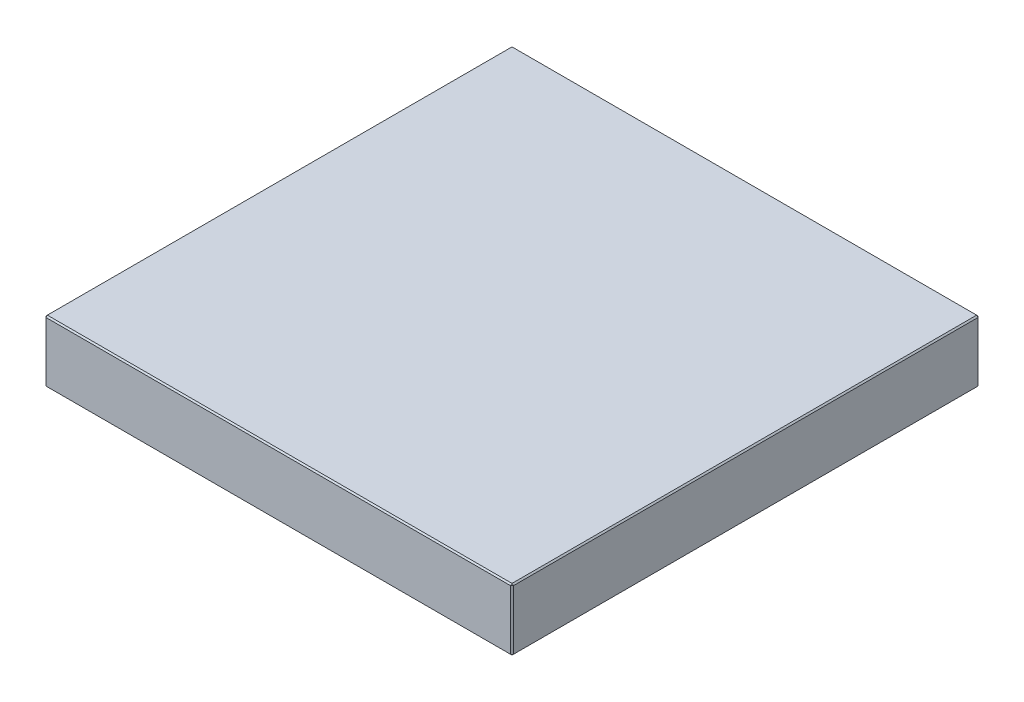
ISO-10303-21;
HEADER;
FILE_DESCRIPTION(('STEP AP214'),'2;1');
FILE_NAME('part.step','',(''),(''),'','','');
FILE_SCHEMA(('AUTOMOTIVE_DESIGN { 1 0 10303 214 1 1 1 1 }'));
ENDSEC;
DATA;
#1=APPLICATION_CONTEXT('core data for automotive mechanical design processes');
#2=APPLICATION_PROTOCOL_DEFINITION('international standard','automotive_design',2000,#1);
#3=PRODUCT_CONTEXT('',#1,'mechanical');
#4=PRODUCT('Part','Part','',(#3));
#5=PRODUCT_RELATED_PRODUCT_CATEGORY('part','',(#4));
#6=PRODUCT_DEFINITION_FORMATION('','',#4);
#7=PRODUCT_DEFINITION_CONTEXT('part definition',#1,'design');
#8=PRODUCT_DEFINITION('design','',#6,#7);
#9=PRODUCT_DEFINITION_SHAPE('','',#8);
#10=(LENGTH_UNIT() NAMED_UNIT(*) SI_UNIT(.MILLI.,.METRE.));
#11=(NAMED_UNIT(*) PLANE_ANGLE_UNIT() SI_UNIT($,.RADIAN.));
#12=(NAMED_UNIT(*) SI_UNIT($,.STERADIAN.) SOLID_ANGLE_UNIT());
#13=UNCERTAINTY_MEASURE_WITH_UNIT(LENGTH_MEASURE(1.E-05),#10,'distance_accuracy_value','');
#14=(GEOMETRIC_REPRESENTATION_CONTEXT(3) GLOBAL_UNCERTAINTY_ASSIGNED_CONTEXT((#13)) GLOBAL_UNIT_ASSIGNED_CONTEXT((#10,
#11,#12)) REPRESENTATION_CONTEXT('',''));
#15=CARTESIAN_POINT('',(0.,0.,0.));
#16=DIRECTION('',(0.,0.,1.));
#17=DIRECTION('',(1.,0.,0.));
#18=AXIS2_PLACEMENT_3D('',#15,#16,#17);
#19=CARTESIAN_POINT('',(-173.,46.,173.));
#20=DIRECTION('',(1.,0.,0.));
#21=DIRECTION('',(0.,0.,-1.));
#22=AXIS2_PLACEMENT_3D('',#19,#20,#21);
#23=PLANE('',#22);
#24=DIRECTION('',(0.,-1.,0.));
#25=VECTOR('',#24,1.);
#26=CARTESIAN_POINT('',(-173.,46.,-172.));
#27=LINE('',#26,#25);
#28=CARTESIAN_POINT('',(-173.,45.,-172.));
#29=VERTEX_POINT('',#28);
#30=CARTESIAN_POINT('',(-173.,1.,-172.));
#31=VERTEX_POINT('',#30);
#32=EDGE_CURVE('E114',#29,#31,#27,.T.);
#33=ORIENTED_EDGE('',*,*,#32,.T.);
#34=DIRECTION('',(0.,0.,1.));
#35=VECTOR('',#34,1.);
#36=CARTESIAN_POINT('',(-173.,1.,173.));
#37=LINE('',#36,#35);
#38=CARTESIAN_POINT('',(-173.,1.,172.));
#39=VERTEX_POINT('',#38);
#40=EDGE_CURVE('E110',#31,#39,#37,.T.);
#41=ORIENTED_EDGE('',*,*,#40,.T.);
#42=DIRECTION('',(0.,1.,0.));
#43=VECTOR('',#42,1.);
#44=CARTESIAN_POINT('',(-173.,46.,172.));
#45=LINE('',#44,#43);
#46=CARTESIAN_POINT('',(-173.,45.,172.));
#47=VERTEX_POINT('',#46);
#48=EDGE_CURVE('E103',#39,#47,#45,.T.);
#49=ORIENTED_EDGE('',*,*,#48,.T.);
#50=DIRECTION('',(0.,0.,-1.));
#51=VECTOR('',#50,1.);
#52=CARTESIAN_POINT('',(-173.,45.,-173.));
#53=LINE('',#52,#51);
#54=EDGE_CURVE('E107',#47,#29,#53,.T.);
#55=ORIENTED_EDGE('',*,*,#54,.T.);
#56=EDGE_LOOP('',(#33,#41,#49,#55));
#57=FACE_BOUND('',#56,.T.);
#58=ADVANCED_FACE('F15',(#57),#23,.F.);
#59=CARTESIAN_POINT('',(173.,46.,173.));
#60=DIRECTION('',(0.,0.,-1.));
#61=DIRECTION('',(-1.,0.,0.));
#62=AXIS2_PLACEMENT_3D('',#59,#60,#61);
#63=PLANE('',#62);
#64=DIRECTION('',(-1.,0.,0.));
#65=VECTOR('',#64,1.);
#66=CARTESIAN_POINT('',(-173.,45.,173.));
#67=LINE('',#66,#65);
#68=CARTESIAN_POINT('',(172.,45.,173.));
#69=VERTEX_POINT('',#68);
#70=CARTESIAN_POINT('',(-172.,45.,173.));
#71=VERTEX_POINT('',#70);
#72=EDGE_CURVE('E164',#69,#71,#67,.T.);
#73=ORIENTED_EDGE('',*,*,#72,.T.);
#74=DIRECTION('',(0.,-1.,0.));
#75=VECTOR('',#74,1.);
#76=CARTESIAN_POINT('',(-172.,46.,173.));
#77=LINE('',#76,#75);
#78=CARTESIAN_POINT('',(-172.,1.,173.));
#79=VERTEX_POINT('',#78);
#80=EDGE_CURVE('E122',#71,#79,#77,.T.);
#81=ORIENTED_EDGE('',*,*,#80,.T.);
#82=DIRECTION('',(1.,0.,0.));
#83=VECTOR('',#82,1.);
#84=CARTESIAN_POINT('',(173.,1.,173.));
#85=LINE('',#84,#83);
#86=CARTESIAN_POINT('',(172.,1.,173.));
#87=VERTEX_POINT('',#86);
#88=EDGE_CURVE('E168',#79,#87,#85,.T.);
#89=ORIENTED_EDGE('',*,*,#88,.T.);
#90=DIRECTION('',(0.,1.,0.));
#91=VECTOR('',#90,1.);
#92=CARTESIAN_POINT('',(172.,46.,173.));
#93=LINE('',#92,#91);
#94=EDGE_CURVE('E166',#87,#69,#93,.T.);
#95=ORIENTED_EDGE('',*,*,#94,.T.);
#96=EDGE_LOOP('',(#73,#81,#89,#95));
#97=FACE_BOUND('',#96,.T.);
#98=ADVANCED_FACE('F275',(#97),#63,.F.);
#99=CARTESIAN_POINT('',(173.,46.,173.));
#100=DIRECTION('',(-1.,0.,0.));
#101=DIRECTION('',(0.,0.,1.));
#102=AXIS2_PLACEMENT_3D('',#99,#100,#101);
#103=PLANE('',#102);
#104=DIRECTION('',(0.,0.,-1.));
#105=VECTOR('',#104,1.);
#106=CARTESIAN_POINT('',(173.,1.,173.));
#107=LINE('',#106,#105);
#108=CARTESIAN_POINT('',(173.,1.,172.));
#109=VERTEX_POINT('',#108);
#110=CARTESIAN_POINT('',(173.,1.,-172.));
#111=VERTEX_POINT('',#110);
#112=EDGE_CURVE('E159',#109,#111,#107,.T.);
#113=ORIENTED_EDGE('',*,*,#112,.T.);
#114=DIRECTION('',(0.,1.,0.));
#115=VECTOR('',#114,1.);
#116=CARTESIAN_POINT('',(173.,46.,-172.));
#117=LINE('',#116,#115);
#118=CARTESIAN_POINT('',(173.,45.,-172.));
#119=VERTEX_POINT('',#118);
#120=EDGE_CURVE('E161',#111,#119,#117,.T.);
#121=ORIENTED_EDGE('',*,*,#120,.T.);
#122=DIRECTION('',(0.,0.,1.));
#123=VECTOR('',#122,1.);
#124=CARTESIAN_POINT('',(173.,45.,173.));
#125=LINE('',#124,#123);
#126=CARTESIAN_POINT('',(173.,45.,172.));
#127=VERTEX_POINT('',#126);
#128=EDGE_CURVE('E155',#119,#127,#125,.T.);
#129=ORIENTED_EDGE('',*,*,#128,.T.);
#130=DIRECTION('',(0.,-1.,0.));
#131=VECTOR('',#130,1.);
#132=CARTESIAN_POINT('',(173.,46.,172.));
#133=LINE('',#132,#131);
#134=EDGE_CURVE('E157',#127,#109,#133,.T.);
#135=ORIENTED_EDGE('',*,*,#134,.T.);
#136=EDGE_LOOP('',(#113,#121,#129,#135));
#137=FACE_BOUND('',#136,.T.);
#138=ADVANCED_FACE('F254',(#137),#103,.F.);
#139=CARTESIAN_POINT('',(173.,46.,-173.));
#140=DIRECTION('',(0.,0.,1.));
#141=DIRECTION('',(1.,0.,0.));
#142=AXIS2_PLACEMENT_3D('',#139,#140,#141);
#143=PLANE('',#142);
#144=DIRECTION('',(0.,-1.,0.));
#145=VECTOR('',#144,1.);
#146=CARTESIAN_POINT('',(172.,46.,-173.));
#147=LINE('',#146,#145);
#148=CARTESIAN_POINT('',(172.,45.,-173.));
#149=VERTEX_POINT('',#148);
#150=CARTESIAN_POINT('',(172.,1.,-173.));
#151=VERTEX_POINT('',#150);
#152=EDGE_CURVE('E148',#149,#151,#147,.T.);
#153=ORIENTED_EDGE('',*,*,#152,.T.);
#154=DIRECTION('',(-1.,0.,0.));
#155=VECTOR('',#154,1.);
#156=CARTESIAN_POINT('',(173.,1.,-173.));
#157=LINE('',#156,#155);
#158=CARTESIAN_POINT('',(-172.,1.,-173.));
#159=VERTEX_POINT('',#158);
#160=EDGE_CURVE('E153',#151,#159,#157,.T.);
#161=ORIENTED_EDGE('',*,*,#160,.T.);
#162=DIRECTION('',(0.,1.,0.));
#163=VECTOR('',#162,1.);
#164=CARTESIAN_POINT('',(-172.,46.,-173.));
#165=LINE('',#164,#163);
#166=CARTESIAN_POINT('',(-172.,45.,-173.));
#167=VERTEX_POINT('',#166);
#168=EDGE_CURVE('E150',#159,#167,#165,.T.);
#169=ORIENTED_EDGE('',*,*,#168,.T.);
#170=DIRECTION('',(1.,0.,0.));
#171=VECTOR('',#170,1.);
#172=CARTESIAN_POINT('',(173.,45.,-173.));
#173=LINE('',#172,#171);
#174=EDGE_CURVE('E146',#167,#149,#173,.T.);
#175=ORIENTED_EDGE('',*,*,#174,.T.);
#176=EDGE_LOOP('',(#153,#161,#169,#175));
#177=FACE_BOUND('',#176,.T.);
#178=ADVANCED_FACE('F284',(#177),#143,.F.);
#179=CARTESIAN_POINT('',(0.,46.,0.));
#180=DIRECTION('',(0.,1.,0.));
#181=DIRECTION('',(0.,0.,1.));
#182=AXIS2_PLACEMENT_3D('',#179,#180,#181);
#183=PLANE('',#182);
#184=DIRECTION('',(0.,0.,-1.));
#185=VECTOR('',#184,1.);
#186=CARTESIAN_POINT('',(172.,46.,-173.));
#187=LINE('',#186,#185);
#188=CARTESIAN_POINT('',(172.,46.,172.));
#189=VERTEX_POINT('',#188);
#190=CARTESIAN_POINT('',(172.,46.,-172.));
#191=VERTEX_POINT('',#190);
#192=EDGE_CURVE('E24',#189,#191,#187,.T.);
#193=ORIENTED_EDGE('',*,*,#192,.T.);
#194=DIRECTION('',(-1.,0.,0.));
#195=VECTOR('',#194,1.);
#196=CARTESIAN_POINT('',(-173.,46.,-172.));
#197=LINE('',#196,#195);
#198=CARTESIAN_POINT('',(-172.,46.,-172.));
#199=VERTEX_POINT('',#198);
#200=EDGE_CURVE('E9',#191,#199,#197,.T.);
#201=ORIENTED_EDGE('',*,*,#200,.T.);
#202=DIRECTION('',(0.,0.,1.));
#203=VECTOR('',#202,1.);
#204=CARTESIAN_POINT('',(-172.,46.,173.));
#205=LINE('',#204,#203);
#206=CARTESIAN_POINT('',(-172.,46.,172.));
#207=VERTEX_POINT('',#206);
#208=EDGE_CURVE('E180',#199,#207,#205,.T.);
#209=ORIENTED_EDGE('',*,*,#208,.T.);
#210=DIRECTION('',(1.,0.,0.));
#211=VECTOR('',#210,1.);
#212=CARTESIAN_POINT('',(173.,46.,172.));
#213=LINE('',#212,#211);
#214=EDGE_CURVE('E35',#207,#189,#213,.T.);
#215=ORIENTED_EDGE('',*,*,#214,.T.);
#216=EDGE_LOOP('',(#193,#201,#209,#215));
#217=FACE_BOUND('',#216,.T.);
#218=ADVANCED_FACE('F350',(#217),#183,.T.);
#219=CARTESIAN_POINT('',(0.,0.,0.));
#220=DIRECTION('',(0.,1.,0.));
#221=DIRECTION('',(0.,0.,1.));
#222=AXIS2_PLACEMENT_3D('',#219,#220,#221);
#223=PLANE('',#222);
#224=DIRECTION('',(0.,0.,1.));
#225=VECTOR('',#224,1.);
#226=CARTESIAN_POINT('',(172.,0.,0.));
#227=LINE('',#226,#225);
#228=CARTESIAN_POINT('',(172.,0.,-172.));
#229=VERTEX_POINT('',#228);
#230=CARTESIAN_POINT('',(172.,0.,172.));
#231=VERTEX_POINT('',#230);
#232=EDGE_CURVE('E171',#229,#231,#227,.T.);
#233=ORIENTED_EDGE('',*,*,#232,.T.);
#234=DIRECTION('',(-1.,0.,0.));
#235=VECTOR('',#234,1.);
#236=CARTESIAN_POINT('',(0.,0.,172.));
#237=LINE('',#236,#235);
#238=CARTESIAN_POINT('',(-172.,0.,172.));
#239=VERTEX_POINT('',#238);
#240=EDGE_CURVE('E177',#231,#239,#237,.T.);
#241=ORIENTED_EDGE('',*,*,#240,.T.);
#242=DIRECTION('',(0.,0.,-1.));
#243=VECTOR('',#242,1.);
#244=CARTESIAN_POINT('',(-172.,0.,0.));
#245=LINE('',#244,#243);
#246=CARTESIAN_POINT('',(-172.,0.,-172.));
#247=VERTEX_POINT('',#246);
#248=EDGE_CURVE('E175',#239,#247,#245,.T.);
#249=ORIENTED_EDGE('',*,*,#248,.T.);
#250=DIRECTION('',(1.,0.,0.));
#251=VECTOR('',#250,1.);
#252=CARTESIAN_POINT('',(0.,0.,-172.));
#253=LINE('',#252,#251);
#254=EDGE_CURVE('E173',#247,#229,#253,.T.);
#255=ORIENTED_EDGE('',*,*,#254,.T.);
#256=EDGE_LOOP('',(#233,#241,#249,#255));
#257=FACE_BOUND('',#256,.T.);
#258=ADVANCED_FACE('F246',(#257),#223,.F.);
#259=CARTESIAN_POINT('',(173.,46.,172.));
#260=DIRECTION('',(-0.707106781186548,0.,-0.707106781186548));
#261=DIRECTION('',(0.,-1.,0.));
#262=AXIS2_PLACEMENT_3D('',#259,#260,#261);
#263=PLANE('',#262);
#264=DIRECTION('',(-0.707106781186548,0.,0.707106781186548));
#265=VECTOR('',#264,1.);
#266=CARTESIAN_POINT('',(172.,45.,173.));
#267=LINE('',#266,#265);
#268=EDGE_CURVE('E19',#69,#127,#267,.F.);
#269=ORIENTED_EDGE('',*,*,#268,.F.);
#270=ORIENTED_EDGE('',*,*,#94,.F.);
#271=DIRECTION('',(0.707106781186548,0.,-0.707106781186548));
#272=VECTOR('',#271,1.);
#273=CARTESIAN_POINT('',(172.,1.,173.));
#274=LINE('',#273,#272);
#275=EDGE_CURVE('E142',#109,#87,#274,.F.);
#276=ORIENTED_EDGE('',*,*,#275,.F.);
#277=ORIENTED_EDGE('',*,*,#134,.F.);
#278=EDGE_LOOP('',(#269,#270,#276,#277));
#279=FACE_BOUND('',#278,.T.);
#280=ADVANCED_FACE('F17',(#279),#263,.F.);
#281=CARTESIAN_POINT('',(172.,45.,173.));
#282=DIRECTION('',(0.57735026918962,0.577350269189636,0.57735026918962));
#283=DIRECTION('',(0.,-0.707106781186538,0.707106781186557));
#284=AXIS2_PLACEMENT_3D('',#281,#282,#283);
#285=PLANE('',#284);
#286=DIRECTION('',(0.,-0.707106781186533,0.707106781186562));
#287=VECTOR('',#286,1.);
#288=CARTESIAN_POINT('',(172.,45.,173.));
#289=LINE('',#288,#287);
#290=EDGE_CURVE('E226',#69,#189,#289,.F.);
#291=ORIENTED_EDGE('',*,*,#290,.F.);
#292=ORIENTED_EDGE('',*,*,#268,.T.);
#293=DIRECTION('',(-0.707106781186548,0.707106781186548,0.));
#294=VECTOR('',#293,1.);
#295=CARTESIAN_POINT('',(172.5,45.5,172.));
#296=LINE('',#295,#294);
#297=EDGE_CURVE('E228',#189,#127,#296,.F.);
#298=ORIENTED_EDGE('',*,*,#297,.F.);
#299=EDGE_LOOP('',(#291,#292,#298));
#300=FACE_BOUND('',#299,.T.);
#301=ADVANCED_FACE('F270',(#300),#285,.T.);
#302=CARTESIAN_POINT('',(172.,1.,173.));
#303=DIRECTION('',(0.57735026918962,-0.577350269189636,0.57735026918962));
#304=DIRECTION('',(0.,-0.707106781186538,-0.707106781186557));
#305=AXIS2_PLACEMENT_3D('',#302,#303,#304);
#306=PLANE('',#305);
#307=DIRECTION('',(-0.707106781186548,-0.707106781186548,0.));
#308=VECTOR('',#307,1.);
#309=CARTESIAN_POINT('',(172.5,0.500000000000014,172.));
#310=LINE('',#309,#308);
#311=EDGE_CURVE('E220',#109,#231,#310,.T.);
#312=ORIENTED_EDGE('',*,*,#311,.F.);
#313=ORIENTED_EDGE('',*,*,#275,.T.);
#314=DIRECTION('',(0.,0.707106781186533,0.707106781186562));
#315=VECTOR('',#314,1.);
#316=CARTESIAN_POINT('',(172.,1.,173.));
#317=LINE('',#316,#315);
#318=EDGE_CURVE('E223',#231,#87,#317,.T.);
#319=ORIENTED_EDGE('',*,*,#318,.F.);
#320=EDGE_LOOP('',(#312,#313,#319));
#321=FACE_BOUND('',#320,.T.);
#322=ADVANCED_FACE('F235',(#321),#306,.T.);
#323=CARTESIAN_POINT('',(172.,46.,0.));
#324=DIRECTION('',(0.707106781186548,0.707106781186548,0.));
#325=DIRECTION('',(0.,0.,1.));
#326=AXIS2_PLACEMENT_3D('',#323,#324,#325);
#327=PLANE('',#326);
#328=ORIENTED_EDGE('',*,*,#297,.T.);
#329=ORIENTED_EDGE('',*,*,#128,.F.);
#330=DIRECTION('',(0.707106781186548,-0.707106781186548,0.));
#331=VECTOR('',#330,1.);
#332=CARTESIAN_POINT('',(173.,45.,-172.));
#333=LINE('',#332,#331);
#334=EDGE_CURVE('E215',#191,#119,#333,.T.);
#335=ORIENTED_EDGE('',*,*,#334,.F.);
#336=ORIENTED_EDGE('',*,*,#192,.F.);
#337=EDGE_LOOP('',(#328,#329,#335,#336));
#338=FACE_BOUND('',#337,.T.);
#339=ADVANCED_FACE('F265',(#338),#327,.T.);
#340=CARTESIAN_POINT('',(0.,46.,172.));
#341=DIRECTION('',(0.,0.707106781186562,0.707106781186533));
#342=DIRECTION('',(-1.,0.,0.));
#343=AXIS2_PLACEMENT_3D('',#340,#341,#342);
#344=PLANE('',#343);
#345=ORIENTED_EDGE('',*,*,#290,.T.);
#346=ORIENTED_EDGE('',*,*,#214,.F.);
#347=DIRECTION('',(0.,0.707106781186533,-0.707106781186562));
#348=VECTOR('',#347,1.);
#349=CARTESIAN_POINT('',(-172.,45.5,172.5));
#350=LINE('',#349,#348);
#351=EDGE_CURVE('E126',#71,#207,#350,.T.);
#352=ORIENTED_EDGE('',*,*,#351,.F.);
#353=ORIENTED_EDGE('',*,*,#72,.F.);
#354=EDGE_LOOP('',(#345,#346,#352,#353));
#355=FACE_BOUND('',#354,.T.);
#356=ADVANCED_FACE('F273',(#355),#344,.T.);
#357=CARTESIAN_POINT('',(-172.,46.,173.));
#358=DIRECTION('',(0.707106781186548,0.,-0.707106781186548));
#359=DIRECTION('',(0.,-1.,0.));
#360=AXIS2_PLACEMENT_3D('',#357,#358,#359);
#361=PLANE('',#360);
#362=DIRECTION('',(0.707106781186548,0.,0.707106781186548));
#363=VECTOR('',#362,1.);
#364=CARTESIAN_POINT('',(-172.,1.,173.));
#365=LINE('',#364,#363);
#366=EDGE_CURVE('E127',#79,#39,#365,.F.);
#367=ORIENTED_EDGE('',*,*,#366,.F.);
#368=ORIENTED_EDGE('',*,*,#80,.F.);
#369=DIRECTION('',(-0.707106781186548,0.,-0.707106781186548));
#370=VECTOR('',#369,1.);
#371=CARTESIAN_POINT('',(-173.,45.,172.));
#372=LINE('',#371,#370);
#373=EDGE_CURVE('E118',#47,#71,#372,.F.);
#374=ORIENTED_EDGE('',*,*,#373,.F.);
#375=ORIENTED_EDGE('',*,*,#48,.F.);
#376=EDGE_LOOP('',(#367,#368,#374,#375));
#377=FACE_BOUND('',#376,.T.);
#378=ADVANCED_FACE('F120',(#377),#361,.F.);
#379=CARTESIAN_POINT('',(173.,1.,173.));
#380=DIRECTION('',(0.,0.707106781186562,-0.707106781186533));
#381=DIRECTION('',(1.,0.,0.));
#382=AXIS2_PLACEMENT_3D('',#379,#380,#381);
#383=PLANE('',#382);
#384=ORIENTED_EDGE('',*,*,#318,.T.);
#385=ORIENTED_EDGE('',*,*,#88,.F.);
#386=DIRECTION('',(0.,-0.707106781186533,-0.707106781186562));
#387=VECTOR('',#386,1.);
#388=CARTESIAN_POINT('',(-172.,1.,173.));
#389=LINE('',#388,#387);
#390=EDGE_CURVE('E211',#239,#79,#389,.F.);
#391=ORIENTED_EDGE('',*,*,#390,.F.);
#392=ORIENTED_EDGE('',*,*,#240,.F.);
#393=EDGE_LOOP('',(#384,#385,#391,#392));
#394=FACE_BOUND('',#393,.T.);
#395=ADVANCED_FACE('F243',(#394),#383,.F.);
#396=CARTESIAN_POINT('',(173.,1.,173.));
#397=DIRECTION('',(-0.707106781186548,0.707106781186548,0.));
#398=DIRECTION('',(0.,0.,-1.));
#399=AXIS2_PLACEMENT_3D('',#396,#397,#398);
#400=PLANE('',#399);
#401=ORIENTED_EDGE('',*,*,#311,.T.);
#402=ORIENTED_EDGE('',*,*,#232,.F.);
#403=DIRECTION('',(0.707106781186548,0.707106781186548,0.));
#404=VECTOR('',#403,1.);
#405=CARTESIAN_POINT('',(172.5,0.499999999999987,-172.));
#406=LINE('',#405,#404);
#407=EDGE_CURVE('E208',#111,#229,#406,.F.);
#408=ORIENTED_EDGE('',*,*,#407,.F.);
#409=ORIENTED_EDGE('',*,*,#112,.F.);
#410=EDGE_LOOP('',(#401,#402,#408,#409));
#411=FACE_BOUND('',#410,.T.);
#412=ADVANCED_FACE('F251',(#411),#400,.F.);
#413=CARTESIAN_POINT('',(172.,46.,-173.));
#414=DIRECTION('',(-0.707106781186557,0.,0.707106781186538));
#415=DIRECTION('',(0.,-1.,0.));
#416=AXIS2_PLACEMENT_3D('',#413,#414,#415);
#417=PLANE('',#416);
#418=DIRECTION('',(0.707106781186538,0.,0.707106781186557));
#419=VECTOR('',#418,1.);
#420=CARTESIAN_POINT('',(173.,45.,-172.));
#421=LINE('',#420,#419);
#422=EDGE_CURVE('E217',#119,#149,#421,.F.);
#423=ORIENTED_EDGE('',*,*,#422,.F.);
#424=ORIENTED_EDGE('',*,*,#120,.F.);
#425=DIRECTION('',(-0.707106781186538,0.,-0.707106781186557));
#426=VECTOR('',#425,1.);
#427=CARTESIAN_POINT('',(172.,1.,-173.));
#428=LINE('',#427,#426);
#429=EDGE_CURVE('E205',#151,#111,#428,.F.);
#430=ORIENTED_EDGE('',*,*,#429,.F.);
#431=ORIENTED_EDGE('',*,*,#152,.F.);
#432=EDGE_LOOP('',(#423,#424,#430,#431));
#433=FACE_BOUND('',#432,.T.);
#434=ADVANCED_FACE('F258',(#433),#417,.F.);
#435=CARTESIAN_POINT('',(173.,45.,-172.));
#436=DIRECTION('',(0.577350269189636,0.57735026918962,-0.57735026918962));
#437=DIRECTION('',(-0.707106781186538,0.,-0.707106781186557));
#438=AXIS2_PLACEMENT_3D('',#435,#436,#437);
#439=PLANE('',#438);
#440=ORIENTED_EDGE('',*,*,#334,.T.);
#441=ORIENTED_EDGE('',*,*,#422,.T.);
#442=DIRECTION('',(0.,0.707106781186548,0.707106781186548));
#443=VECTOR('',#442,1.);
#444=CARTESIAN_POINT('',(172.,45.5,-172.5));
#445=LINE('',#444,#443);
#446=EDGE_CURVE('E134',#191,#149,#445,.F.);
#447=ORIENTED_EDGE('',*,*,#446,.F.);
#448=EDGE_LOOP('',(#440,#441,#447));
#449=FACE_BOUND('',#448,.T.);
#450=ADVANCED_FACE('F325',(#449),#439,.T.);
#451=CARTESIAN_POINT('',(-173.,45.,172.));
#452=DIRECTION('',(-0.57735026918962,0.577350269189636,0.57735026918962));
#453=DIRECTION('',(0.,-0.707106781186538,0.707106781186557));
#454=AXIS2_PLACEMENT_3D('',#451,#452,#453);
#455=PLANE('',#454);
#456=ORIENTED_EDGE('',*,*,#373,.T.);
#457=ORIENTED_EDGE('',*,*,#351,.T.);
#458=DIRECTION('',(-0.707106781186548,-0.707106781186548,0.));
#459=VECTOR('',#458,1.);
#460=CARTESIAN_POINT('',(-173.,45.,172.));
#461=LINE('',#460,#459);
#462=EDGE_CURVE('E130',#47,#207,#461,.F.);
#463=ORIENTED_EDGE('',*,*,#462,.F.);
#464=EDGE_LOOP('',(#456,#457,#463));
#465=FACE_BOUND('',#464,.T.);
#466=ADVANCED_FACE('F131',(#465),#455,.T.);
#467=CARTESIAN_POINT('',(-172.,1.,173.));
#468=DIRECTION('',(-0.57735026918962,-0.577350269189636,0.57735026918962));
#469=DIRECTION('',(0.,-0.707106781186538,-0.707106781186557));
#470=AXIS2_PLACEMENT_3D('',#467,#468,#469);
#471=PLANE('',#470);
#472=ORIENTED_EDGE('',*,*,#390,.T.);
#473=ORIENTED_EDGE('',*,*,#366,.T.);
#474=DIRECTION('',(-0.707106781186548,0.707106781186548,0.));
#475=VECTOR('',#474,1.);
#476=CARTESIAN_POINT('',(-172.5,0.500000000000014,172.));
#477=LINE('',#476,#475);
#478=EDGE_CURVE('E135',#239,#39,#477,.T.);
#479=ORIENTED_EDGE('',*,*,#478,.F.);
#480=EDGE_LOOP('',(#472,#473,#479));
#481=FACE_BOUND('',#480,.T.);
#482=ADVANCED_FACE('F318',(#481),#471,.T.);
#483=CARTESIAN_POINT('',(172.,1.,-173.));
#484=DIRECTION('',(0.577350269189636,-0.57735026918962,-0.57735026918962));
#485=DIRECTION('',(-0.707106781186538,0.,-0.707106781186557));
#486=AXIS2_PLACEMENT_3D('',#483,#484,#485);
#487=PLANE('',#486);
#488=ORIENTED_EDGE('',*,*,#429,.T.);
#489=ORIENTED_EDGE('',*,*,#407,.T.);
#490=DIRECTION('',(0.,-0.707106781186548,0.707106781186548));
#491=VECTOR('',#490,1.);
#492=CARTESIAN_POINT('',(172.,1.,-173.));
#493=LINE('',#492,#491);
#494=EDGE_CURVE('E198',#151,#229,#493,.T.);
#495=ORIENTED_EDGE('',*,*,#494,.F.);
#496=EDGE_LOOP('',(#488,#489,#495));
#497=FACE_BOUND('',#496,.T.);
#498=ADVANCED_FACE('F314',(#497),#487,.T.);
#499=CARTESIAN_POINT('',(0.,46.,-172.));
#500=DIRECTION('',(0.,0.707106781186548,-0.707106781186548));
#501=DIRECTION('',(1.,0.,0.));
#502=AXIS2_PLACEMENT_3D('',#499,#500,#501);
#503=PLANE('',#502);
#504=ORIENTED_EDGE('',*,*,#446,.T.);
#505=ORIENTED_EDGE('',*,*,#174,.F.);
#506=DIRECTION('',(0.,-0.707106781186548,-0.707106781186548));
#507=VECTOR('',#506,1.);
#508=CARTESIAN_POINT('',(-172.,45.,-173.));
#509=LINE('',#508,#507);
#510=EDGE_CURVE('E195',#199,#167,#509,.T.);
#511=ORIENTED_EDGE('',*,*,#510,.F.);
#512=ORIENTED_EDGE('',*,*,#200,.F.);
#513=EDGE_LOOP('',(#504,#505,#511,#512));
#514=FACE_BOUND('',#513,.T.);
#515=ADVANCED_FACE('F311',(#514),#503,.T.);
#516=CARTESIAN_POINT('',(-172.,46.,0.));
#517=DIRECTION('',(-0.707106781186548,0.707106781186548,0.));
#518=DIRECTION('',(0.,0.,-1.));
#519=AXIS2_PLACEMENT_3D('',#516,#517,#518);
#520=PLANE('',#519);
#521=ORIENTED_EDGE('',*,*,#462,.T.);
#522=ORIENTED_EDGE('',*,*,#208,.F.);
#523=DIRECTION('',(0.707106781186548,0.707106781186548,0.));
#524=VECTOR('',#523,1.);
#525=CARTESIAN_POINT('',(-172.5,45.5,-172.));
#526=LINE('',#525,#524);
#527=EDGE_CURVE('E138',#29,#199,#526,.T.);
#528=ORIENTED_EDGE('',*,*,#527,.F.);
#529=ORIENTED_EDGE('',*,*,#54,.F.);
#530=EDGE_LOOP('',(#521,#522,#528,#529));
#531=FACE_BOUND('',#530,.T.);
#532=ADVANCED_FACE('F137',(#531),#520,.T.);
#533=CARTESIAN_POINT('',(-173.,1.,173.));
#534=DIRECTION('',(0.707106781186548,0.707106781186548,0.));
#535=DIRECTION('',(0.,0.,1.));
#536=AXIS2_PLACEMENT_3D('',#533,#534,#535);
#537=PLANE('',#536);
#538=ORIENTED_EDGE('',*,*,#478,.T.);
#539=ORIENTED_EDGE('',*,*,#40,.F.);
#540=DIRECTION('',(0.707106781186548,-0.707106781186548,0.));
#541=VECTOR('',#540,1.);
#542=CARTESIAN_POINT('',(-173.,1.,-172.));
#543=LINE('',#542,#541);
#544=EDGE_CURVE('E191',#247,#31,#543,.F.);
#545=ORIENTED_EDGE('',*,*,#544,.F.);
#546=ORIENTED_EDGE('',*,*,#248,.F.);
#547=EDGE_LOOP('',(#538,#539,#545,#546));
#548=FACE_BOUND('',#547,.T.);
#549=ADVANCED_FACE('F304',(#548),#537,.F.);
#550=CARTESIAN_POINT('',(173.,1.,-173.));
#551=DIRECTION('',(0.,0.707106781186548,0.707106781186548));
#552=DIRECTION('',(-1.,0.,0.));
#553=AXIS2_PLACEMENT_3D('',#550,#551,#552);
#554=PLANE('',#553);
#555=ORIENTED_EDGE('',*,*,#494,.T.);
#556=ORIENTED_EDGE('',*,*,#254,.F.);
#557=DIRECTION('',(0.,0.707106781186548,-0.707106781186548));
#558=VECTOR('',#557,1.);
#559=CARTESIAN_POINT('',(-172.,0.5,-172.5));
#560=LINE('',#559,#558);
#561=EDGE_CURVE('E188',#159,#247,#560,.F.);
#562=ORIENTED_EDGE('',*,*,#561,.F.);
#563=ORIENTED_EDGE('',*,*,#160,.F.);
#564=EDGE_LOOP('',(#555,#556,#562,#563));
#565=FACE_BOUND('',#564,.T.);
#566=ADVANCED_FACE('F300',(#565),#554,.F.);
#567=CARTESIAN_POINT('',(-172.,45.,-173.));
#568=DIRECTION('',(-0.577350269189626,0.577350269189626,-0.577350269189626));
#569=DIRECTION('',(-0.707106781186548,0.,0.707106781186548));
#570=AXIS2_PLACEMENT_3D('',#567,#568,#569);
#571=PLANE('',#570);
#572=ORIENTED_EDGE('',*,*,#527,.T.);
#573=ORIENTED_EDGE('',*,*,#510,.T.);
#574=DIRECTION('',(0.707106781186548,0.,-0.707106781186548));
#575=VECTOR('',#574,1.);
#576=CARTESIAN_POINT('',(-172.,45.,-173.));
#577=LINE('',#576,#575);
#578=EDGE_CURVE('E186',#29,#167,#577,.T.);
#579=ORIENTED_EDGE('',*,*,#578,.F.);
#580=EDGE_LOOP('',(#572,#573,#579));
#581=FACE_BOUND('',#580,.T.);
#582=ADVANCED_FACE('F296',(#581),#571,.T.);
#583=CARTESIAN_POINT('',(-173.,1.,-172.));
#584=DIRECTION('',(-0.577350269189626,-0.577350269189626,-0.577350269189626));
#585=DIRECTION('',(-0.707106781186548,0.,0.707106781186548));
#586=AXIS2_PLACEMENT_3D('',#583,#584,#585);
#587=PLANE('',#586);
#588=ORIENTED_EDGE('',*,*,#561,.T.);
#589=ORIENTED_EDGE('',*,*,#544,.T.);
#590=DIRECTION('',(-0.707106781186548,0.,0.707106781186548));
#591=VECTOR('',#590,1.);
#592=CARTESIAN_POINT('',(-173.,1.,-172.));
#593=LINE('',#592,#591);
#594=EDGE_CURVE('E184',#159,#31,#593,.T.);
#595=ORIENTED_EDGE('',*,*,#594,.F.);
#596=EDGE_LOOP('',(#588,#589,#595));
#597=FACE_BOUND('',#596,.T.);
#598=ADVANCED_FACE('F292',(#597),#587,.T.);
#599=CARTESIAN_POINT('',(-173.,46.,-172.));
#600=DIRECTION('',(0.707106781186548,0.,0.707106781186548));
#601=DIRECTION('',(0.,-1.,0.));
#602=AXIS2_PLACEMENT_3D('',#599,#600,#601);
#603=PLANE('',#602);
#604=ORIENTED_EDGE('',*,*,#578,.T.);
#605=ORIENTED_EDGE('',*,*,#168,.F.);
#606=ORIENTED_EDGE('',*,*,#594,.T.);
#607=ORIENTED_EDGE('',*,*,#32,.F.);
#608=EDGE_LOOP('',(#604,#605,#606,#607));
#609=FACE_BOUND('',#608,.T.);
#610=ADVANCED_FACE('F289',(#609),#603,.F.);
#611=CLOSED_SHELL('',(#58,#98,#138,#178,#218,#258,#280,#301,#322,#339,#356,#378,#395,#412,#434,
#450,#466,#482,#498,#515,#532,#549,#566,#582,#598,#610));
#612=MANIFOLD_SOLID_BREP('B1',#611);
#613=ADVANCED_BREP_SHAPE_REPRESENTATION('',(#18,#612),#14);
#614=SHAPE_DEFINITION_REPRESENTATION(#9,#613);
ENDSEC;
END-ISO-10303-21;
